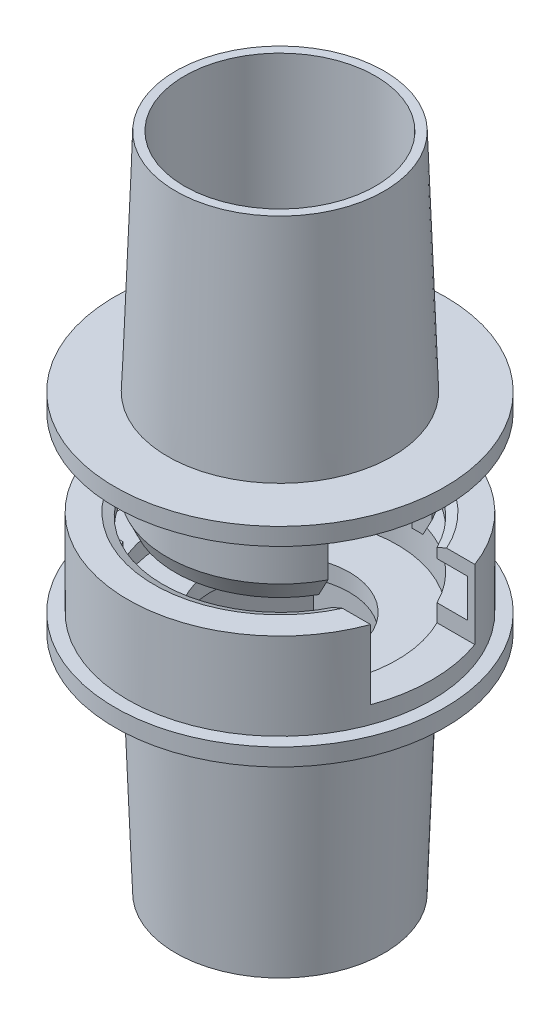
ISO-10303-21;
HEADER;
FILE_DESCRIPTION(('STEP AP214'),'2;1');
FILE_NAME('part.step','',(''),(''),'','','');
FILE_SCHEMA(('AUTOMOTIVE_DESIGN { 1 0 10303 214 1 1 1 1 }'));
ENDSEC;
DATA;
#1=APPLICATION_CONTEXT('core data for automotive mechanical design processes');
#2=APPLICATION_PROTOCOL_DEFINITION('international standard','automotive_design',2000,#1);
#3=PRODUCT_CONTEXT('',#1,'mechanical');
#4=PRODUCT('Part','Part','',(#3));
#5=PRODUCT_RELATED_PRODUCT_CATEGORY('part','',(#4));
#6=PRODUCT_DEFINITION_FORMATION('','',#4);
#7=PRODUCT_DEFINITION_CONTEXT('part definition',#1,'design');
#8=PRODUCT_DEFINITION('design','',#6,#7);
#9=PRODUCT_DEFINITION_SHAPE('','',#8);
#10=(LENGTH_UNIT() NAMED_UNIT(*) SI_UNIT(.MILLI.,.METRE.));
#11=(NAMED_UNIT(*) PLANE_ANGLE_UNIT() SI_UNIT($,.RADIAN.));
#12=(NAMED_UNIT(*) SI_UNIT($,.STERADIAN.) SOLID_ANGLE_UNIT());
#13=UNCERTAINTY_MEASURE_WITH_UNIT(LENGTH_MEASURE(1.E-05),#10,'distance_accuracy_value','');
#14=(GEOMETRIC_REPRESENTATION_CONTEXT(3) GLOBAL_UNCERTAINTY_ASSIGNED_CONTEXT((#13)) GLOBAL_UNIT_ASSIGNED_CONTEXT((#10,
#11,#12)) REPRESENTATION_CONTEXT('',''));
#15=CARTESIAN_POINT('',(0.,0.,0.));
#16=DIRECTION('',(0.,0.,1.));
#17=DIRECTION('',(1.,0.,0.));
#18=AXIS2_PLACEMENT_3D('',#15,#16,#17);
#19=CARTESIAN_POINT('',(0.,-5.,0.));
#20=DIRECTION('',(0.,1.,0.));
#21=DIRECTION('',(0.,0.,1.));
#22=AXIS2_PLACEMENT_3D('',#19,#20,#21);
#23=PLANE('',#22);
#24=DIRECTION('',(-1.,0.,0.));
#25=VECTOR('',#24,1.);
#26=CARTESIAN_POINT('',(0.,-5.,-3.));
#27=LINE('',#26,#25);
#28=CARTESIAN_POINT('',(-6.60018939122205,-5.,-3.));
#29=VERTEX_POINT('',#28);
#30=CARTESIAN_POINT('',(-8.2196411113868,-5.,-3.));
#31=VERTEX_POINT('',#30);
#32=EDGE_CURVE('E338',#29,#31,#27,.T.);
#33=ORIENTED_EDGE('',*,*,#32,.F.);
#34=CARTESIAN_POINT('',(0.,-5.,0.));
#35=DIRECTION('',(0.,1.,0.));
#36=DIRECTION('',(0.,0.,1.));
#37=AXIS2_PLACEMENT_3D('',#34,#35,#36);
#38=CIRCLE('',#37,7.25);
#39=CARTESIAN_POINT('',(6.60018939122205,-5.,-3.));
#40=VERTEX_POINT('',#39);
#41=EDGE_CURVE('E449',#29,#40,#38,.F.);
#42=ORIENTED_EDGE('',*,*,#41,.T.);
#43=CARTESIAN_POINT('',(8.2196411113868,-5.,-3.));
#44=VERTEX_POINT('',#43);
#45=EDGE_CURVE('E342',#44,#40,#27,.T.);
#46=ORIENTED_EDGE('',*,*,#45,.F.);
#47=CARTESIAN_POINT('',(0.,-5.,0.));
#48=DIRECTION('',(0.,1.,0.));
#49=DIRECTION('',(0.,0.,1.));
#50=AXIS2_PLACEMENT_3D('',#47,#48,#49);
#51=CIRCLE('',#50,8.75);
#52=EDGE_CURVE('E391',#44,#31,#51,.T.);
#53=ORIENTED_EDGE('',*,*,#52,.T.);
#54=EDGE_LOOP('',(#33,#42,#46,#53));
#55=FACE_BOUND('',#54,.T.);
#56=ADVANCED_FACE('F58',(#55),#23,.T.);
#57=CARTESIAN_POINT('',(0.,-5.,0.));
#58=DIRECTION('',(0.,-1.,0.));
#59=DIRECTION('',(0.,0.,-1.));
#60=AXIS2_PLACEMENT_3D('',#57,#58,#59);
#61=CYLINDRICAL_SURFACE('',#60,6.75);
#62=DIRECTION('',(0.,-1.,0.));
#63=VECTOR('',#62,1.);
#64=CARTESIAN_POINT('',(6.04669331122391,-5.,-3.));
#65=LINE('',#64,#63);
#66=CARTESIAN_POINT('',(6.04669331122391,-5.2331538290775,-3.));
#67=VERTEX_POINT('',#66);
#68=CARTESIAN_POINT('',(6.04669331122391,-5.8,-3.));
#69=VERTEX_POINT('',#68);
#70=EDGE_CURVE('E349',#67,#69,#65,.T.);
#71=ORIENTED_EDGE('',*,*,#70,.F.);
#72=CARTESIAN_POINT('',(0.,-5.2331538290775,0.));
#73=DIRECTION('',(0.,1.,0.));
#74=DIRECTION('',(0.,0.,1.));
#75=AXIS2_PLACEMENT_3D('',#72,#73,#74);
#76=CIRCLE('',#75,6.75);
#77=CARTESIAN_POINT('',(-6.04669331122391,-5.2331538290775,-3.));
#78=VERTEX_POINT('',#77);
#79=EDGE_CURVE('E437',#67,#78,#76,.T.);
#80=ORIENTED_EDGE('',*,*,#79,.T.);
#81=DIRECTION('',(0.,-1.,0.));
#82=VECTOR('',#81,1.);
#83=CARTESIAN_POINT('',(-6.04669331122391,-5.,-3.));
#84=LINE('',#83,#82);
#85=CARTESIAN_POINT('',(-6.04669331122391,-5.8,-3.));
#86=VERTEX_POINT('',#85);
#87=EDGE_CURVE('E333',#86,#78,#84,.F.);
#88=ORIENTED_EDGE('',*,*,#87,.F.);
#89=CARTESIAN_POINT('',(0.,-5.8,0.));
#90=DIRECTION('',(0.,1.,0.));
#91=DIRECTION('',(0.,0.,1.));
#92=AXIS2_PLACEMENT_3D('',#89,#90,#91);
#93=CIRCLE('',#92,6.75);
#94=EDGE_CURVE('E367',#69,#86,#93,.T.);
#95=ORIENTED_EDGE('',*,*,#94,.F.);
#96=EDGE_LOOP('',(#71,#80,#88,#95));
#97=FACE_BOUND('',#96,.T.);
#98=ADVANCED_FACE('F558',(#97),#61,.F.);
#99=CARTESIAN_POINT('',(0.,-5.8,0.));
#100=DIRECTION('',(0.,1.,0.));
#101=DIRECTION('',(0.,0.,1.));
#102=AXIS2_PLACEMENT_3D('',#99,#100,#101);
#103=PLANE('',#102);
#104=CARTESIAN_POINT('',(0.,-5.8,0.));
#105=DIRECTION('',(0.,1.,0.));
#106=DIRECTION('',(0.,0.,1.));
#107=AXIS2_PLACEMENT_3D('',#104,#105,#106);
#108=CIRCLE('',#107,8.35);
#109=CARTESIAN_POINT('',(7.79246430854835,-5.8,-3.));
#110=VERTEX_POINT('',#109);
#111=CARTESIAN_POINT('',(-7.79246430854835,-5.8,-3.));
#112=VERTEX_POINT('',#111);
#113=EDGE_CURVE('E377',#110,#112,#108,.T.);
#114=ORIENTED_EDGE('',*,*,#113,.F.);
#115=DIRECTION('',(-1.,0.,0.));
#116=VECTOR('',#115,1.);
#117=CARTESIAN_POINT('',(0.,-5.8,-3.));
#118=LINE('',#117,#116);
#119=EDGE_CURVE('E334',#110,#69,#118,.T.);
#120=ORIENTED_EDGE('',*,*,#119,.T.);
#121=ORIENTED_EDGE('',*,*,#94,.T.);
#122=EDGE_CURVE('E328',#86,#112,#118,.T.);
#123=ORIENTED_EDGE('',*,*,#122,.T.);
#124=EDGE_LOOP('',(#114,#120,#121,#123));
#125=FACE_BOUND('',#124,.T.);
#126=ADVANCED_FACE('F565',(#125),#103,.F.);
#127=CARTESIAN_POINT('',(0.,-8.,0.));
#128=DIRECTION('',(0.,1.,0.));
#129=DIRECTION('',(0.,0.,1.));
#130=AXIS2_PLACEMENT_3D('',#127,#128,#129);
#131=PLANE('',#130);
#132=DIRECTION('',(-1.,0.,0.));
#133=VECTOR('',#132,1.);
#134=CARTESIAN_POINT('',(0.,-8.,-3.));
#135=LINE('',#134,#133);
#136=CARTESIAN_POINT('',(7.79246430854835,-8.,-3.));
#137=VERTEX_POINT('',#136);
#138=CARTESIAN_POINT('',(6.04669331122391,-8.,-3.));
#139=VERTEX_POINT('',#138);
#140=EDGE_CURVE('E329',#137,#139,#135,.T.);
#141=ORIENTED_EDGE('',*,*,#140,.F.);
#142=CARTESIAN_POINT('',(0.,-8.,0.));
#143=DIRECTION('',(0.,1.,0.));
#144=DIRECTION('',(0.,0.,1.));
#145=AXIS2_PLACEMENT_3D('',#142,#143,#144);
#146=CIRCLE('',#145,8.35);
#147=CARTESIAN_POINT('',(-7.79246430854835,-8.,-3.));
#148=VERTEX_POINT('',#147);
#149=EDGE_CURVE('E378',#137,#148,#146,.T.);
#150=ORIENTED_EDGE('',*,*,#149,.T.);
#151=CARTESIAN_POINT('',(-6.04669331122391,-8.,-3.));
#152=VERTEX_POINT('',#151);
#153=EDGE_CURVE('E325',#152,#148,#135,.T.);
#154=ORIENTED_EDGE('',*,*,#153,.F.);
#155=CARTESIAN_POINT('',(0.,-8.,0.));
#156=DIRECTION('',(0.,1.,0.));
#157=DIRECTION('',(0.,0.,1.));
#158=AXIS2_PLACEMENT_3D('',#155,#156,#157);
#159=CIRCLE('',#158,6.75);
#160=EDGE_CURVE('E368',#139,#152,#159,.T.);
#161=ORIENTED_EDGE('',*,*,#160,.F.);
#162=EDGE_LOOP('',(#141,#150,#154,#161));
#163=FACE_BOUND('',#162,.T.);
#164=ADVANCED_FACE('F636',(#163),#131,.T.);
#165=CARTESIAN_POINT('',(0.,-5.8,0.));
#166=DIRECTION('',(0.,-1.,0.));
#167=DIRECTION('',(0.,0.,-1.));
#168=AXIS2_PLACEMENT_3D('',#165,#166,#167);
#169=CYLINDRICAL_SURFACE('',#168,8.35);
#170=DIRECTION('',(0.,-1.,0.));
#171=VECTOR('',#170,1.);
#172=CARTESIAN_POINT('',(7.79246430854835,-5.8,-3.));
#173=LINE('',#172,#171);
#174=EDGE_CURVE('E429',#110,#137,#173,.T.);
#175=ORIENTED_EDGE('',*,*,#174,.F.);
#176=ORIENTED_EDGE('',*,*,#113,.T.);
#177=DIRECTION('',(0.,-1.,0.));
#178=VECTOR('',#177,1.);
#179=CARTESIAN_POINT('',(-7.79246430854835,-5.8,-3.));
#180=LINE('',#179,#178);
#181=EDGE_CURVE('E426',#148,#112,#180,.F.);
#182=ORIENTED_EDGE('',*,*,#181,.F.);
#183=ORIENTED_EDGE('',*,*,#149,.F.);
#184=EDGE_LOOP('',(#175,#176,#182,#183));
#185=FACE_BOUND('',#184,.T.);
#186=ADVANCED_FACE('F631',(#185),#169,.F.);
#187=DIRECTION('',(0.,-1.,0.));
#188=VECTOR('',#187,1.);
#189=CARTESIAN_POINT('',(6.04669331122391,-5.,-3.));
#190=LINE('',#189,#188);
#191=CARTESIAN_POINT('',(6.04669331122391,-9.,-3.));
#192=VERTEX_POINT('',#191);
#193=EDGE_CURVE('E352',#139,#192,#190,.T.);
#194=ORIENTED_EDGE('',*,*,#193,.F.);
#195=ORIENTED_EDGE('',*,*,#160,.T.);
#196=DIRECTION('',(0.,-1.,0.));
#197=VECTOR('',#196,1.);
#198=CARTESIAN_POINT('',(-6.04669331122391,-5.,-3.));
#199=LINE('',#198,#197);
#200=CARTESIAN_POINT('',(-6.04669331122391,-9.,-3.));
#201=VERTEX_POINT('',#200);
#202=EDGE_CURVE('E341',#201,#152,#199,.F.);
#203=ORIENTED_EDGE('',*,*,#202,.F.);
#204=CARTESIAN_POINT('',(0.,-9.,0.));
#205=DIRECTION('',(0.,-1.,0.));
#206=DIRECTION('',(0.,0.,-1.));
#207=AXIS2_PLACEMENT_3D('',#204,#205,#206);
#208=CIRCLE('',#207,6.75);
#209=CARTESIAN_POINT('',(-6.04669331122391,-9.,3.));
#210=VERTEX_POINT('',#209);
#211=EDGE_CURVE('E359',#210,#201,#208,.T.);
#212=ORIENTED_EDGE('',*,*,#211,.F.);
#213=DIRECTION('',(0.,-1.,0.));
#214=VECTOR('',#213,1.);
#215=CARTESIAN_POINT('',(-6.04669331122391,-5.,3.));
#216=LINE('',#215,#214);
#217=CARTESIAN_POINT('',(-6.04669331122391,-8.,3.));
#218=VERTEX_POINT('',#217);
#219=EDGE_CURVE('E318',#218,#210,#216,.T.);
#220=ORIENTED_EDGE('',*,*,#219,.F.);
#221=CARTESIAN_POINT('',(6.04669331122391,-8.,3.));
#222=VERTEX_POINT('',#221);
#223=EDGE_CURVE('E369',#218,#222,#159,.T.);
#224=ORIENTED_EDGE('',*,*,#223,.T.);
#225=DIRECTION('',(0.,-1.,0.));
#226=VECTOR('',#225,1.);
#227=CARTESIAN_POINT('',(6.04669331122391,-5.,3.));
#228=LINE('',#227,#226);
#229=CARTESIAN_POINT('',(6.04669331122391,-9.,3.));
#230=VERTEX_POINT('',#229);
#231=EDGE_CURVE('E307',#230,#222,#228,.F.);
#232=ORIENTED_EDGE('',*,*,#231,.F.);
#233=EDGE_CURVE('E362',#192,#230,#208,.T.);
#234=ORIENTED_EDGE('',*,*,#233,.F.);
#235=EDGE_LOOP('',(#194,#195,#203,#212,#220,#224,#232,#234));
#236=FACE_BOUND('',#235,.T.);
#237=CARTESIAN_POINT('',(0.,-10.,0.));
#238=DIRECTION('',(0.,1.,0.));
#239=DIRECTION('',(0.,0.,1.));
#240=AXIS2_PLACEMENT_3D('',#237,#238,#239);
#241=CIRCLE('',#240,6.75);
#242=CARTESIAN_POINT('',(0.,-10.,6.75));
#243=VERTEX_POINT('',#242);
#244=EDGE_CURVE('E383',#243,#243,#241,.T.);
#245=ORIENTED_EDGE('',*,*,#244,.F.);
#246=EDGE_LOOP('',(#245));
#247=FACE_BOUND('',#246,.T.);
#248=ADVANCED_FACE('F568',(#236,#247),#61,.F.);
#249=CARTESIAN_POINT('',(-4.,-10.,0.));
#250=DIRECTION('',(0.,-1.,0.));
#251=DIRECTION('',(0.,0.,1.));
#252=AXIS2_PLACEMENT_3D('',#249,#250,#251);
#253=PLANE('',#252);
#254=CARTESIAN_POINT('',(0.,-10.,0.));
#255=DIRECTION('',(0.,-1.,0.));
#256=DIRECTION('',(0.,0.,-1.));
#257=AXIS2_PLACEMENT_3D('',#254,#255,#256);
#258=CIRCLE('',#257,4.);
#259=CARTESIAN_POINT('',(0.,-10.,-4.));
#260=VERTEX_POINT('',#259);
#261=EDGE_CURVE('E406',#260,#260,#258,.T.);
#262=ORIENTED_EDGE('',*,*,#261,.T.);
#263=EDGE_LOOP('',(#262));
#264=FACE_BOUND('',#263,.T.);
#265=ORIENTED_EDGE('',*,*,#244,.T.);
#266=EDGE_LOOP('',(#265));
#267=FACE_BOUND('',#266,.T.);
#268=ADVANCED_FACE('F798',(#264,#267),#253,.F.);
#269=CARTESIAN_POINT('',(0.,-24.,0.));
#270=DIRECTION('',(0.,1.,0.));
#271=DIRECTION('',(0.,0.,-1.));
#272=AXIS2_PLACEMENT_3D('',#269,#270,#271);
#273=CONICAL_SURFACE('',#272,6.,0.0356991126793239);
#274=CARTESIAN_POINT('',(0.,-11.,0.));
#275=DIRECTION('',(0.,-1.,0.));
#276=DIRECTION('',(0.,0.,-1.));
#277=AXIS2_PLACEMENT_3D('',#274,#275,#276);
#278=CIRCLE('',#277,6.46428571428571);
#279=CARTESIAN_POINT('',(0.,-11.,-6.46428571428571));
#280=VERTEX_POINT('',#279);
#281=EDGE_CURVE('E397',#280,#280,#278,.T.);
#282=ORIENTED_EDGE('',*,*,#281,.T.);
#283=EDGE_LOOP('',(#282));
#284=FACE_BOUND('',#283,.T.);
#285=CARTESIAN_POINT('',(0.,-24.,0.));
#286=DIRECTION('',(0.,-1.,0.));
#287=DIRECTION('',(0.,0.,-1.));
#288=AXIS2_PLACEMENT_3D('',#285,#286,#287);
#289=CIRCLE('',#288,6.);
#290=CARTESIAN_POINT('',(0.,-24.,-6.));
#291=VERTEX_POINT('',#290);
#292=EDGE_CURVE('E398',#291,#291,#289,.T.);
#293=ORIENTED_EDGE('',*,*,#292,.F.);
#294=EDGE_LOOP('',(#293));
#295=FACE_BOUND('',#294,.T.);
#296=ADVANCED_FACE('F818',(#284,#295),#273,.T.);
#297=CARTESIAN_POINT('',(-9.5,-11.,0.));
#298=DIRECTION('',(0.,1.,0.));
#299=DIRECTION('',(0.,0.,-1.));
#300=AXIS2_PLACEMENT_3D('',#297,#298,#299);
#301=PLANE('',#300);
#302=CARTESIAN_POINT('',(0.,-11.,0.));
#303=DIRECTION('',(0.,-1.,0.));
#304=DIRECTION('',(0.,0.,-1.));
#305=AXIS2_PLACEMENT_3D('',#302,#303,#304);
#306=CIRCLE('',#305,9.5);
#307=CARTESIAN_POINT('',(0.,-11.,-9.5));
#308=VERTEX_POINT('',#307);
#309=EDGE_CURVE('E414',#308,#308,#306,.T.);
#310=ORIENTED_EDGE('',*,*,#309,.T.);
#311=EDGE_LOOP('',(#310));
#312=FACE_BOUND('',#311,.T.);
#313=ORIENTED_EDGE('',*,*,#281,.F.);
#314=EDGE_LOOP('',(#313));
#315=FACE_BOUND('',#314,.T.);
#316=ADVANCED_FACE('F866',(#312,#315),#301,.F.);
#317=CARTESIAN_POINT('',(0.,-10.,0.));
#318=DIRECTION('',(0.,1.,0.));
#319=DIRECTION('',(0.,0.,-1.));
#320=AXIS2_PLACEMENT_3D('',#317,#318,#319);
#321=CYLINDRICAL_SURFACE('',#320,9.5);
#322=CARTESIAN_POINT('',(0.,-10.,0.));
#323=DIRECTION('',(0.,-1.,0.));
#324=DIRECTION('',(0.,0.,-1.));
#325=AXIS2_PLACEMENT_3D('',#322,#323,#324);
#326=CIRCLE('',#325,9.5);
#327=CARTESIAN_POINT('',(0.,-10.,-9.5));
#328=VERTEX_POINT('',#327);
#329=EDGE_CURVE('E410',#328,#328,#326,.T.);
#330=ORIENTED_EDGE('',*,*,#329,.T.);
#331=EDGE_LOOP('',(#330));
#332=FACE_BOUND('',#331,.T.);
#333=ORIENTED_EDGE('',*,*,#309,.F.);
#334=EDGE_LOOP('',(#333));
#335=FACE_BOUND('',#334,.T.);
#336=ADVANCED_FACE('F837',(#332,#335),#321,.T.);
#337=CARTESIAN_POINT('',(0.,-10.,0.));
#338=DIRECTION('',(0.,1.,0.));
#339=DIRECTION('',(0.,0.,1.));
#340=AXIS2_PLACEMENT_3D('',#337,#338,#339);
#341=CIRCLE('',#340,8.75);
#342=CARTESIAN_POINT('',(0.,-10.,8.75));
#343=VERTEX_POINT('',#342);
#344=EDGE_CURVE('E392',#343,#343,#341,.T.);
#345=ORIENTED_EDGE('',*,*,#344,.F.);
#346=EDGE_LOOP('',(#345));
#347=FACE_BOUND('',#346,.T.);
#348=ORIENTED_EDGE('',*,*,#329,.F.);
#349=EDGE_LOOP('',(#348));
#350=FACE_BOUND('',#349,.T.);
#351=ADVANCED_FACE('F821',(#347,#350),#253,.F.);
#352=CARTESIAN_POINT('',(0.,-10.,0.));
#353=DIRECTION('',(0.,1.,0.));
#354=DIRECTION('',(0.,0.,-1.));
#355=AXIS2_PLACEMENT_3D('',#352,#353,#354);
#356=CYLINDRICAL_SURFACE('',#355,4.);
#357=CARTESIAN_POINT('',(0.,-11.,0.));
#358=DIRECTION('',(0.,-1.,0.));
#359=DIRECTION('',(0.,0.,-1.));
#360=AXIS2_PLACEMENT_3D('',#357,#358,#359);
#361=CIRCLE('',#360,4.);
#362=CARTESIAN_POINT('',(0.,-11.,-4.));
#363=VERTEX_POINT('',#362);
#364=EDGE_CURVE('E402',#363,#363,#361,.T.);
#365=ORIENTED_EDGE('',*,*,#364,.T.);
#366=EDGE_LOOP('',(#365));
#367=FACE_BOUND('',#366,.T.);
#368=ORIENTED_EDGE('',*,*,#261,.F.);
#369=EDGE_LOOP('',(#368));
#370=FACE_BOUND('',#369,.T.);
#371=ADVANCED_FACE('F829',(#367,#370),#356,.F.);
#372=CARTESIAN_POINT('',(-4.,-11.,0.));
#373=DIRECTION('',(0.,1.,0.));
#374=DIRECTION('',(0.,0.,-1.));
#375=AXIS2_PLACEMENT_3D('',#372,#373,#374);
#376=PLANE('',#375);
#377=DIRECTION('',(-1.,0.,0.));
#378=VECTOR('',#377,1.);
#379=CARTESIAN_POINT('',(2.625,-11.,4.5466333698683));
#380=LINE('',#379,#378);
#381=CARTESIAN_POINT('',(2.625,-11.,4.5466333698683));
#382=VERTEX_POINT('',#381);
#383=CARTESIAN_POINT('',(-2.625,-11.,4.5466333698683));
#384=VERTEX_POINT('',#383);
#385=EDGE_CURVE('E252',#382,#384,#380,.T.);
#386=ORIENTED_EDGE('',*,*,#385,.T.);
#387=DIRECTION('',(-0.5,0.,-0.866025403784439));
#388=VECTOR('',#387,1.);
#389=CARTESIAN_POINT('',(-2.625,-11.,4.5466333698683));
#390=LINE('',#389,#388);
#391=CARTESIAN_POINT('',(-5.25,-11.,0.));
#392=VERTEX_POINT('',#391);
#393=EDGE_CURVE('E81',#384,#392,#390,.T.);
#394=ORIENTED_EDGE('',*,*,#393,.T.);
#395=DIRECTION('',(0.5,0.,-0.866025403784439));
#396=VECTOR('',#395,1.);
#397=CARTESIAN_POINT('',(-5.25,-11.,0.));
#398=LINE('',#397,#396);
#399=CARTESIAN_POINT('',(-2.625,-11.,-4.5466333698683));
#400=VERTEX_POINT('',#399);
#401=EDGE_CURVE('E249',#392,#400,#398,.T.);
#402=ORIENTED_EDGE('',*,*,#401,.T.);
#403=DIRECTION('',(1.,0.,0.));
#404=VECTOR('',#403,1.);
#405=CARTESIAN_POINT('',(-2.625,-11.,-4.5466333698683));
#406=LINE('',#405,#404);
#407=CARTESIAN_POINT('',(2.625,-11.,-4.5466333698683));
#408=VERTEX_POINT('',#407);
#409=EDGE_CURVE('E536',#400,#408,#406,.T.);
#410=ORIENTED_EDGE('',*,*,#409,.T.);
#411=DIRECTION('',(0.5,0.,0.866025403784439));
#412=VECTOR('',#411,1.);
#413=CARTESIAN_POINT('',(2.625,-11.,-4.5466333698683));
#414=LINE('',#413,#412);
#415=CARTESIAN_POINT('',(5.25,-11.,0.));
#416=VERTEX_POINT('',#415);
#417=EDGE_CURVE('E532',#408,#416,#414,.T.);
#418=ORIENTED_EDGE('',*,*,#417,.T.);
#419=DIRECTION('',(-0.5,0.,0.866025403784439));
#420=VECTOR('',#419,1.);
#421=CARTESIAN_POINT('',(5.25,-11.,0.));
#422=LINE('',#421,#420);
#423=EDGE_CURVE('E259',#416,#382,#422,.T.);
#424=ORIENTED_EDGE('',*,*,#423,.T.);
#425=EDGE_LOOP('',(#386,#394,#402,#410,#418,#424));
#426=FACE_BOUND('',#425,.T.);
#427=ORIENTED_EDGE('',*,*,#364,.F.);
#428=EDGE_LOOP('',(#427));
#429=FACE_BOUND('',#428,.T.);
#430=ADVANCED_FACE('F528',(#426,#429),#376,.F.);
#431=CARTESIAN_POINT('',(-5.5,-24.,0.));
#432=DIRECTION('',(0.,1.,0.));
#433=DIRECTION('',(0.,0.,-1.));
#434=AXIS2_PLACEMENT_3D('',#431,#432,#433);
#435=PLANE('',#434);
#436=ORIENTED_EDGE('',*,*,#292,.T.);
#437=EDGE_LOOP('',(#436));
#438=FACE_BOUND('',#437,.T.);
#439=DIRECTION('',(0.5,0.,0.866025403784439));
#440=VECTOR('',#439,1.);
#441=CARTESIAN_POINT('',(-2.625,-24.,4.5466333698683));
#442=LINE('',#441,#440);
#443=CARTESIAN_POINT('',(-5.25,-24.,0.));
#444=VERTEX_POINT('',#443);
#445=CARTESIAN_POINT('',(-2.625,-24.,4.5466333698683));
#446=VERTEX_POINT('',#445);
#447=EDGE_CURVE('E230',#444,#446,#442,.T.);
#448=ORIENTED_EDGE('',*,*,#447,.T.);
#449=DIRECTION('',(1.,0.,0.));
#450=VECTOR('',#449,1.);
#451=CARTESIAN_POINT('',(2.625,-24.,4.5466333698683));
#452=LINE('',#451,#450);
#453=CARTESIAN_POINT('',(2.625,-24.,4.5466333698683));
#454=VERTEX_POINT('',#453);
#455=EDGE_CURVE('E245',#446,#454,#452,.T.);
#456=ORIENTED_EDGE('',*,*,#455,.T.);
#457=DIRECTION('',(0.5,0.,-0.866025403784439));
#458=VECTOR('',#457,1.);
#459=CARTESIAN_POINT('',(5.25,-24.,0.));
#460=LINE('',#459,#458);
#461=CARTESIAN_POINT('',(5.25,-24.,0.));
#462=VERTEX_POINT('',#461);
#463=EDGE_CURVE('E279',#454,#462,#460,.T.);
#464=ORIENTED_EDGE('',*,*,#463,.T.);
#465=DIRECTION('',(-0.5,0.,-0.866025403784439));
#466=VECTOR('',#465,1.);
#467=CARTESIAN_POINT('',(2.625,-24.,-4.5466333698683));
#468=LINE('',#467,#466);
#469=CARTESIAN_POINT('',(2.625,-24.,-4.5466333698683));
#470=VERTEX_POINT('',#469);
#471=EDGE_CURVE('E276',#462,#470,#468,.T.);
#472=ORIENTED_EDGE('',*,*,#471,.T.);
#473=DIRECTION('',(-1.,0.,0.));
#474=VECTOR('',#473,1.);
#475=CARTESIAN_POINT('',(-2.625,-24.,-4.5466333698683));
#476=LINE('',#475,#474);
#477=CARTESIAN_POINT('',(-2.625,-24.,-4.5466333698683));
#478=VERTEX_POINT('',#477);
#479=EDGE_CURVE('E232',#470,#478,#476,.T.);
#480=ORIENTED_EDGE('',*,*,#479,.T.);
#481=DIRECTION('',(-0.5,0.,0.866025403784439));
#482=VECTOR('',#481,1.);
#483=CARTESIAN_POINT('',(-5.25,-24.,0.));
#484=LINE('',#483,#482);
#485=EDGE_CURVE('E227',#478,#444,#484,.T.);
#486=ORIENTED_EDGE('',*,*,#485,.T.);
#487=EDGE_LOOP('',(#448,#456,#464,#472,#480,#486));
#488=FACE_BOUND('',#487,.T.);
#489=ADVANCED_FACE('F229',(#438,#488),#435,.F.);
#490=DIRECTION('',(1.,0.,0.));
#491=VECTOR('',#490,1.);
#492=CARTESIAN_POINT('',(0.,-5.,3.));
#493=LINE('',#492,#491);
#494=CARTESIAN_POINT('',(6.60018939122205,-5.,3.));
#495=VERTEX_POINT('',#494);
#496=CARTESIAN_POINT('',(8.2196411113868,-5.,3.));
#497=VERTEX_POINT('',#496);
#498=EDGE_CURVE('E304',#495,#497,#493,.T.);
#499=ORIENTED_EDGE('',*,*,#498,.F.);
#500=CARTESIAN_POINT('',(0.,-5.,0.));
#501=DIRECTION('',(0.,1.,0.));
#502=DIRECTION('',(0.,0.,1.));
#503=AXIS2_PLACEMENT_3D('',#500,#501,#502);
#504=CIRCLE('',#503,7.25);
#505=CARTESIAN_POINT('',(-6.60018939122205,-5.,3.));
#506=VERTEX_POINT('',#505);
#507=EDGE_CURVE('E74',#495,#506,#504,.F.);
#508=ORIENTED_EDGE('',*,*,#507,.T.);
#509=CARTESIAN_POINT('',(-8.2196411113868,-5.,3.));
#510=VERTEX_POINT('',#509);
#511=EDGE_CURVE('E308',#510,#506,#493,.T.);
#512=ORIENTED_EDGE('',*,*,#511,.F.);
#513=EDGE_CURVE('E387',#510,#497,#51,.T.);
#514=ORIENTED_EDGE('',*,*,#513,.T.);
#515=EDGE_LOOP('',(#499,#508,#512,#514));
#516=FACE_BOUND('',#515,.T.);
#517=ADVANCED_FACE('F561',(#516),#23,.T.);
#518=CARTESIAN_POINT('',(0.,-5.,0.));
#519=DIRECTION('',(0.,-1.,0.));
#520=DIRECTION('',(0.,0.,-1.));
#521=AXIS2_PLACEMENT_3D('',#518,#519,#520);
#522=CYLINDRICAL_SURFACE('',#521,8.75);
#523=ORIENTED_EDGE('',*,*,#52,.F.);
#524=DIRECTION('',(0.,-1.,0.));
#525=VECTOR('',#524,1.);
#526=CARTESIAN_POINT('',(8.2196411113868,-5.,-3.));
#527=LINE('',#526,#525);
#528=CARTESIAN_POINT('',(8.2196411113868,-9.,-3.));
#529=VERTEX_POINT('',#528);
#530=EDGE_CURVE('E355',#44,#529,#527,.T.);
#531=ORIENTED_EDGE('',*,*,#530,.T.);
#532=CARTESIAN_POINT('',(0.,-9.,0.));
#533=DIRECTION('',(0.,-1.,0.));
#534=DIRECTION('',(0.,0.,-1.));
#535=AXIS2_PLACEMENT_3D('',#532,#533,#534);
#536=CIRCLE('',#535,8.75);
#537=CARTESIAN_POINT('',(8.2196411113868,-9.,3.));
#538=VERTEX_POINT('',#537);
#539=EDGE_CURVE('E436',#529,#538,#536,.T.);
#540=ORIENTED_EDGE('',*,*,#539,.T.);
#541=DIRECTION('',(0.,-1.,0.));
#542=VECTOR('',#541,1.);
#543=CARTESIAN_POINT('',(8.2196411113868,-5.,3.));
#544=LINE('',#543,#542);
#545=EDGE_CURVE('E311',#538,#497,#544,.F.);
#546=ORIENTED_EDGE('',*,*,#545,.T.);
#547=ORIENTED_EDGE('',*,*,#513,.F.);
#548=DIRECTION('',(0.,-1.,0.));
#549=VECTOR('',#548,1.);
#550=CARTESIAN_POINT('',(-8.2196411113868,-5.,3.));
#551=LINE('',#550,#549);
#552=CARTESIAN_POINT('',(-8.2196411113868,-9.,3.));
#553=VERTEX_POINT('',#552);
#554=EDGE_CURVE('E321',#510,#553,#551,.T.);
#555=ORIENTED_EDGE('',*,*,#554,.T.);
#556=CARTESIAN_POINT('',(-8.2196411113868,-9.,-3.));
#557=VERTEX_POINT('',#556);
#558=EDGE_CURVE('E432',#553,#557,#536,.T.);
#559=ORIENTED_EDGE('',*,*,#558,.T.);
#560=DIRECTION('',(0.,-1.,0.));
#561=VECTOR('',#560,1.);
#562=CARTESIAN_POINT('',(-8.2196411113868,-5.,-3.));
#563=LINE('',#562,#561);
#564=EDGE_CURVE('E345',#557,#31,#563,.F.);
#565=ORIENTED_EDGE('',*,*,#564,.T.);
#566=EDGE_LOOP('',(#523,#531,#540,#546,#547,#555,#559,#565));
#567=FACE_BOUND('',#566,.T.);
#568=ORIENTED_EDGE('',*,*,#344,.T.);
#569=EDGE_LOOP('',(#568));
#570=FACE_BOUND('',#569,.T.);
#571=ADVANCED_FACE('F573',(#567,#570),#522,.T.);
#572=DIRECTION('',(0.,-1.,0.));
#573=VECTOR('',#572,1.);
#574=CARTESIAN_POINT('',(-6.04669331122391,-5.,3.));
#575=LINE('',#574,#573);
#576=CARTESIAN_POINT('',(-6.04669331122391,-5.2331538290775,3.));
#577=VERTEX_POINT('',#576);
#578=CARTESIAN_POINT('',(-6.04669331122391,-5.8,3.));
#579=VERTEX_POINT('',#578);
#580=EDGE_CURVE('E315',#577,#579,#575,.T.);
#581=ORIENTED_EDGE('',*,*,#580,.F.);
#582=CARTESIAN_POINT('',(0.,-5.2331538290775,0.));
#583=DIRECTION('',(0.,1.,0.));
#584=DIRECTION('',(0.,0.,1.));
#585=AXIS2_PLACEMENT_3D('',#582,#583,#584);
#586=CIRCLE('',#585,6.75);
#587=CARTESIAN_POINT('',(6.04669331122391,-5.2331538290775,3.));
#588=VERTEX_POINT('',#587);
#589=EDGE_CURVE('E476',#577,#588,#586,.T.);
#590=ORIENTED_EDGE('',*,*,#589,.T.);
#591=DIRECTION('',(0.,-1.,0.));
#592=VECTOR('',#591,1.);
#593=CARTESIAN_POINT('',(6.04669331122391,-5.,3.));
#594=LINE('',#593,#592);
#595=CARTESIAN_POINT('',(6.04669331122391,-5.8,3.));
#596=VERTEX_POINT('',#595);
#597=EDGE_CURVE('E299',#596,#588,#594,.F.);
#598=ORIENTED_EDGE('',*,*,#597,.F.);
#599=EDGE_CURVE('E363',#579,#596,#93,.T.);
#600=ORIENTED_EDGE('',*,*,#599,.F.);
#601=EDGE_LOOP('',(#581,#590,#598,#600));
#602=FACE_BOUND('',#601,.T.);
#603=ADVANCED_FACE('F569',(#602),#61,.F.);
#604=CARTESIAN_POINT('',(-7.79246430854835,-5.8,3.));
#605=VERTEX_POINT('',#604);
#606=CARTESIAN_POINT('',(7.79246430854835,-5.8,3.));
#607=VERTEX_POINT('',#606);
#608=EDGE_CURVE('E373',#605,#607,#108,.T.);
#609=ORIENTED_EDGE('',*,*,#608,.F.);
#610=DIRECTION('',(1.,0.,0.));
#611=VECTOR('',#610,1.);
#612=CARTESIAN_POINT('',(0.,-5.8,3.));
#613=LINE('',#612,#611);
#614=EDGE_CURVE('E300',#605,#579,#613,.T.);
#615=ORIENTED_EDGE('',*,*,#614,.T.);
#616=ORIENTED_EDGE('',*,*,#599,.T.);
#617=EDGE_CURVE('E294',#596,#607,#613,.T.);
#618=ORIENTED_EDGE('',*,*,#617,.T.);
#619=EDGE_LOOP('',(#609,#615,#616,#618));
#620=FACE_BOUND('',#619,.T.);
#621=ADVANCED_FACE('F466',(#620),#103,.F.);
#622=DIRECTION('',(1.,0.,0.));
#623=VECTOR('',#622,1.);
#624=CARTESIAN_POINT('',(0.,-8.,3.));
#625=LINE('',#624,#623);
#626=CARTESIAN_POINT('',(-7.79246430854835,-8.,3.));
#627=VERTEX_POINT('',#626);
#628=EDGE_CURVE('E295',#627,#218,#625,.T.);
#629=ORIENTED_EDGE('',*,*,#628,.F.);
#630=CARTESIAN_POINT('',(7.79246430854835,-8.,3.));
#631=VERTEX_POINT('',#630);
#632=EDGE_CURVE('E379',#627,#631,#146,.T.);
#633=ORIENTED_EDGE('',*,*,#632,.T.);
#634=EDGE_CURVE('E291',#222,#631,#625,.T.);
#635=ORIENTED_EDGE('',*,*,#634,.F.);
#636=ORIENTED_EDGE('',*,*,#223,.F.);
#637=EDGE_LOOP('',(#629,#633,#635,#636));
#638=FACE_BOUND('',#637,.T.);
#639=ADVANCED_FACE('F601',(#638),#131,.T.);
#640=DIRECTION('',(0.,-1.,0.));
#641=VECTOR('',#640,1.);
#642=CARTESIAN_POINT('',(-7.79246430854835,-5.8,3.));
#643=LINE('',#642,#641);
#644=EDGE_CURVE('E423',#605,#627,#643,.T.);
#645=ORIENTED_EDGE('',*,*,#644,.F.);
#646=ORIENTED_EDGE('',*,*,#608,.T.);
#647=DIRECTION('',(0.,-1.,0.));
#648=VECTOR('',#647,1.);
#649=CARTESIAN_POINT('',(7.79246430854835,-5.8,3.));
#650=LINE('',#649,#648);
#651=EDGE_CURVE('E396',#631,#607,#650,.F.);
#652=ORIENTED_EDGE('',*,*,#651,.F.);
#653=ORIENTED_EDGE('',*,*,#632,.F.);
#654=EDGE_LOOP('',(#645,#646,#652,#653));
#655=FACE_BOUND('',#654,.T.);
#656=ADVANCED_FACE('F597',(#655),#169,.F.);
#657=CARTESIAN_POINT('',(-9.64938070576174,20.3021162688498,3.));
#658=DIRECTION('',(0.,0.,1.));
#659=DIRECTION('',(1.,0.,0.));
#660=AXIS2_PLACEMENT_3D('',#657,#658,#659);
#661=PLANE('',#660);
#662=ORIENTED_EDGE('',*,*,#597,.T.);
#663=CARTESIAN_POINT('',(6.04669331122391,-5.2331538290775,3.));
#664=CARTESIAN_POINT('',(6.13905459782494,-5.19456057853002,3.));
#665=CARTESIAN_POINT('',(6.23135991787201,-5.15583446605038,3.));
#666=CARTESIAN_POINT('',(6.41585861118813,-5.07811652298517,3.));
#667=CARTESIAN_POINT('',(6.50805198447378,-5.03912469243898,3.));
#668=CARTESIAN_POINT('',(6.60018939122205,-5.,3.));
#669=B_SPLINE_CURVE_WITH_KNOTS('',3,(#663,#664,#665,#666,#667,#668),.UNSPECIFIED.,.F.,.F.,(4,2,
4),(0.,0.300299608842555,0.60059917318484),.UNSPECIFIED.);
#670=EDGE_CURVE('E480',#588,#495,#669,.T.);
#671=ORIENTED_EDGE('',*,*,#670,.T.);
#672=ORIENTED_EDGE('',*,*,#498,.T.);
#673=ORIENTED_EDGE('',*,*,#545,.F.);
#674=DIRECTION('',(-1.,0.,0.));
#675=VECTOR('',#674,1.);
#676=CARTESIAN_POINT('',(-9.64938070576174,-9.,3.));
#677=LINE('',#676,#675);
#678=EDGE_CURVE('E287',#538,#230,#677,.T.);
#679=ORIENTED_EDGE('',*,*,#678,.T.);
#680=ORIENTED_EDGE('',*,*,#231,.T.);
#681=ORIENTED_EDGE('',*,*,#634,.T.);
#682=ORIENTED_EDGE('',*,*,#651,.T.);
#683=ORIENTED_EDGE('',*,*,#617,.F.);
#684=EDGE_LOOP('',(#662,#671,#672,#673,#679,#680,#681,#682,#683));
#685=FACE_BOUND('',#684,.T.);
#686=ADVANCED_FACE('F460',(#685),#661,.F.);
#687=CARTESIAN_POINT('',(-9.64938070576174,20.3021162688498,-3.));
#688=DIRECTION('',(0.,0.,-1.));
#689=DIRECTION('',(-1.,0.,0.));
#690=AXIS2_PLACEMENT_3D('',#687,#688,#689);
#691=PLANE('',#690);
#692=ORIENTED_EDGE('',*,*,#45,.T.);
#693=CARTESIAN_POINT('',(6.60018939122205,-5.,-3.));
#694=CARTESIAN_POINT('',(6.50805198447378,-5.03912469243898,-3.));
#695=CARTESIAN_POINT('',(6.41585861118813,-5.07811652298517,-3.));
#696=CARTESIAN_POINT('',(6.23135991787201,-5.15583446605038,-3.));
#697=CARTESIAN_POINT('',(6.13905459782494,-5.19456057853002,-3.));
#698=CARTESIAN_POINT('',(6.04669331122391,-5.2331538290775,-3.));
#699=B_SPLINE_CURVE_WITH_KNOTS('',3,(#693,#694,#695,#696,#697,#698),.UNSPECIFIED.,.F.,.F.,(4,2,
4),(0.,0.300299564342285,0.60059917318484),.UNSPECIFIED.);
#700=EDGE_CURVE('E469',#40,#67,#699,.T.);
#701=ORIENTED_EDGE('',*,*,#700,.T.);
#702=ORIENTED_EDGE('',*,*,#70,.T.);
#703=ORIENTED_EDGE('',*,*,#119,.F.);
#704=ORIENTED_EDGE('',*,*,#174,.T.);
#705=ORIENTED_EDGE('',*,*,#140,.T.);
#706=ORIENTED_EDGE('',*,*,#193,.T.);
#707=DIRECTION('',(1.,0.,0.));
#708=VECTOR('',#707,1.);
#709=CARTESIAN_POINT('',(-9.64938070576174,-9.,-3.));
#710=LINE('',#709,#708);
#711=EDGE_CURVE('E282',#192,#529,#710,.T.);
#712=ORIENTED_EDGE('',*,*,#711,.T.);
#713=ORIENTED_EDGE('',*,*,#530,.F.);
#714=EDGE_LOOP('',(#692,#701,#702,#703,#704,#705,#706,#712,#713));
#715=FACE_BOUND('',#714,.T.);
#716=ADVANCED_FACE('F455',(#715),#691,.F.);
#717=CARTESIAN_POINT('',(-4.,-9.,0.));
#718=DIRECTION('',(0.,-1.,0.));
#719=DIRECTION('',(0.,0.,1.));
#720=AXIS2_PLACEMENT_3D('',#717,#718,#719);
#721=PLANE('',#720);
#722=ORIENTED_EDGE('',*,*,#233,.T.);
#723=ORIENTED_EDGE('',*,*,#678,.F.);
#724=ORIENTED_EDGE('',*,*,#539,.F.);
#725=ORIENTED_EDGE('',*,*,#711,.F.);
#726=EDGE_LOOP('',(#722,#723,#724,#725));
#727=FACE_BOUND('',#726,.T.);
#728=ADVANCED_FACE('F459',(#727),#721,.F.);
#729=ORIENTED_EDGE('',*,*,#211,.T.);
#730=EDGE_CURVE('E286',#557,#201,#710,.T.);
#731=ORIENTED_EDGE('',*,*,#730,.F.);
#732=ORIENTED_EDGE('',*,*,#558,.F.);
#733=EDGE_CURVE('E237',#210,#553,#677,.T.);
#734=ORIENTED_EDGE('',*,*,#733,.F.);
#735=EDGE_LOOP('',(#729,#731,#732,#734));
#736=FACE_BOUND('',#735,.T.);
#737=ADVANCED_FACE('F613',(#736),#721,.F.);
#738=ORIENTED_EDGE('',*,*,#87,.T.);
#739=CARTESIAN_POINT('',(-6.04669331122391,-5.2331538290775,-3.));
#740=CARTESIAN_POINT('',(-6.13905459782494,-5.19456057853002,-3.));
#741=CARTESIAN_POINT('',(-6.23135991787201,-5.15583446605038,-3.));
#742=CARTESIAN_POINT('',(-6.41585861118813,-5.07811652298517,-3.));
#743=CARTESIAN_POINT('',(-6.50805198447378,-5.03912469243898,-3.));
#744=CARTESIAN_POINT('',(-6.60018939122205,-5.,-3.));
#745=B_SPLINE_CURVE_WITH_KNOTS('',3,(#739,#740,#741,#742,#743,#744),.UNSPECIFIED.,.F.,.F.,(4,2,
4),(0.,0.300299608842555,0.60059917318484),.UNSPECIFIED.);
#746=EDGE_CURVE('E441',#78,#29,#745,.T.);
#747=ORIENTED_EDGE('',*,*,#746,.T.);
#748=ORIENTED_EDGE('',*,*,#32,.T.);
#749=ORIENTED_EDGE('',*,*,#564,.F.);
#750=ORIENTED_EDGE('',*,*,#730,.T.);
#751=ORIENTED_EDGE('',*,*,#202,.T.);
#752=ORIENTED_EDGE('',*,*,#153,.T.);
#753=ORIENTED_EDGE('',*,*,#181,.T.);
#754=ORIENTED_EDGE('',*,*,#122,.F.);
#755=EDGE_LOOP('',(#738,#747,#748,#749,#750,#751,#752,#753,#754));
#756=FACE_BOUND('',#755,.T.);
#757=ADVANCED_FACE('F462',(#756),#691,.F.);
#758=ORIENTED_EDGE('',*,*,#511,.T.);
#759=CARTESIAN_POINT('',(-6.60018939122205,-5.,3.));
#760=CARTESIAN_POINT('',(-6.50805198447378,-5.03912469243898,3.));
#761=CARTESIAN_POINT('',(-6.41585861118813,-5.07811652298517,3.));
#762=CARTESIAN_POINT('',(-6.23135991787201,-5.15583446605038,3.));
#763=CARTESIAN_POINT('',(-6.13905459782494,-5.19456057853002,3.));
#764=CARTESIAN_POINT('',(-6.04669331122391,-5.2331538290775,3.));
#765=B_SPLINE_CURVE_WITH_KNOTS('',3,(#759,#760,#761,#762,#763,#764),.UNSPECIFIED.,.F.,.F.,(4,2,
4),(0.,0.300299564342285,0.60059917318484),.UNSPECIFIED.);
#766=EDGE_CURVE('E14',#506,#577,#765,.T.);
#767=ORIENTED_EDGE('',*,*,#766,.T.);
#768=ORIENTED_EDGE('',*,*,#580,.T.);
#769=ORIENTED_EDGE('',*,*,#614,.F.);
#770=ORIENTED_EDGE('',*,*,#644,.T.);
#771=ORIENTED_EDGE('',*,*,#628,.T.);
#772=ORIENTED_EDGE('',*,*,#219,.T.);
#773=ORIENTED_EDGE('',*,*,#733,.T.);
#774=ORIENTED_EDGE('',*,*,#554,.F.);
#775=EDGE_LOOP('',(#758,#767,#768,#769,#770,#771,#772,#773,#774));
#776=FACE_BOUND('',#775,.T.);
#777=ADVANCED_FACE('F463',(#776),#661,.F.);
#778=CARTESIAN_POINT('',(0.,-5.2331538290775,0.));
#779=DIRECTION('',(0.,1.,0.));
#780=DIRECTION('',(0.,0.,1.));
#781=AXIS2_PLACEMENT_3D('',#778,#779,#780);
#782=CONICAL_SURFACE('',#781,6.75,1.13446401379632);
#783=ORIENTED_EDGE('',*,*,#700,.F.);
#784=ORIENTED_EDGE('',*,*,#41,.F.);
#785=ORIENTED_EDGE('',*,*,#746,.F.);
#786=ORIENTED_EDGE('',*,*,#79,.F.);
#787=EDGE_LOOP('',(#783,#784,#785,#786));
#788=FACE_BOUND('',#787,.T.);
#789=ADVANCED_FACE('F452',(#788),#782,.F.);
#790=CARTESIAN_POINT('',(0.,-5.2331538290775,0.));
#791=DIRECTION('',(0.,1.,0.));
#792=DIRECTION('',(0.,0.,1.));
#793=AXIS2_PLACEMENT_3D('',#790,#791,#792);
#794=CONICAL_SURFACE('',#793,6.75,1.13446401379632);
#795=ORIENTED_EDGE('',*,*,#766,.F.);
#796=ORIENTED_EDGE('',*,*,#507,.F.);
#797=ORIENTED_EDGE('',*,*,#670,.F.);
#798=ORIENTED_EDGE('',*,*,#589,.F.);
#799=EDGE_LOOP('',(#795,#796,#797,#798));
#800=FACE_BOUND('',#799,.T.);
#801=ADVANCED_FACE('F61',(#800),#794,.F.);
#802=CARTESIAN_POINT('',(-2.625,-39.556349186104,4.5466333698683));
#803=DIRECTION('',(0.866025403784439,0.,-0.5));
#804=DIRECTION('',(-0.5,0.,-0.866025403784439));
#805=AXIS2_PLACEMENT_3D('',#802,#803,#804);
#806=PLANE('',#805);
#807=ORIENTED_EDGE('',*,*,#447,.F.);
#808=DIRECTION('',(0.,1.,0.));
#809=VECTOR('',#808,1.);
#810=CARTESIAN_POINT('',(-5.25,-39.556349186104,0.));
#811=LINE('',#810,#809);
#812=EDGE_CURVE('E240',#444,#392,#811,.T.);
#813=ORIENTED_EDGE('',*,*,#812,.T.);
#814=ORIENTED_EDGE('',*,*,#393,.F.);
#815=DIRECTION('',(0.,1.,0.));
#816=VECTOR('',#815,1.);
#817=CARTESIAN_POINT('',(-2.625,-39.556349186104,4.5466333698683));
#818=LINE('',#817,#816);
#819=EDGE_CURVE('E242',#446,#384,#818,.T.);
#820=ORIENTED_EDGE('',*,*,#819,.F.);
#821=EDGE_LOOP('',(#807,#813,#814,#820));
#822=FACE_BOUND('',#821,.T.);
#823=ADVANCED_FACE('F239',(#822),#806,.T.);
#824=CARTESIAN_POINT('',(-5.25,-39.556349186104,0.));
#825=DIRECTION('',(0.866025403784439,0.,0.5));
#826=DIRECTION('',(0.5,0.,-0.866025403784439));
#827=AXIS2_PLACEMENT_3D('',#824,#825,#826);
#828=PLANE('',#827);
#829=ORIENTED_EDGE('',*,*,#485,.F.);
#830=DIRECTION('',(0.,1.,0.));
#831=VECTOR('',#830,1.);
#832=CARTESIAN_POINT('',(-2.625,-39.556349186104,-4.5466333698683));
#833=LINE('',#832,#831);
#834=EDGE_CURVE('E251',#478,#400,#833,.T.);
#835=ORIENTED_EDGE('',*,*,#834,.T.);
#836=ORIENTED_EDGE('',*,*,#401,.F.);
#837=ORIENTED_EDGE('',*,*,#812,.F.);
#838=EDGE_LOOP('',(#829,#835,#836,#837));
#839=FACE_BOUND('',#838,.T.);
#840=ADVANCED_FACE('F247',(#839),#828,.T.);
#841=CARTESIAN_POINT('',(-2.625,-39.556349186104,-4.5466333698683));
#842=DIRECTION('',(0.,0.,1.));
#843=DIRECTION('',(1.,0.,0.));
#844=AXIS2_PLACEMENT_3D('',#841,#842,#843);
#845=PLANE('',#844);
#846=ORIENTED_EDGE('',*,*,#479,.F.);
#847=DIRECTION('',(0.,1.,0.));
#848=VECTOR('',#847,1.);
#849=CARTESIAN_POINT('',(2.625,-39.556349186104,-4.5466333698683));
#850=LINE('',#849,#848);
#851=EDGE_CURVE('E256',#470,#408,#850,.T.);
#852=ORIENTED_EDGE('',*,*,#851,.T.);
#853=ORIENTED_EDGE('',*,*,#409,.F.);
#854=ORIENTED_EDGE('',*,*,#834,.F.);
#855=EDGE_LOOP('',(#846,#852,#853,#854));
#856=FACE_BOUND('',#855,.T.);
#857=ADVANCED_FACE('F545',(#856),#845,.T.);
#858=CARTESIAN_POINT('',(2.625,-39.556349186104,-4.5466333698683));
#859=DIRECTION('',(-0.866025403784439,0.,0.5));
#860=DIRECTION('',(0.5,0.,0.866025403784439));
#861=AXIS2_PLACEMENT_3D('',#858,#859,#860);
#862=PLANE('',#861);
#863=ORIENTED_EDGE('',*,*,#471,.F.);
#864=DIRECTION('',(0.,1.,0.));
#865=VECTOR('',#864,1.);
#866=CARTESIAN_POINT('',(5.25,-39.556349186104,0.));
#867=LINE('',#866,#865);
#868=EDGE_CURVE('E266',#462,#416,#867,.T.);
#869=ORIENTED_EDGE('',*,*,#868,.T.);
#870=ORIENTED_EDGE('',*,*,#417,.F.);
#871=ORIENTED_EDGE('',*,*,#851,.F.);
#872=EDGE_LOOP('',(#863,#869,#870,#871));
#873=FACE_BOUND('',#872,.T.);
#874=ADVANCED_FACE('F548',(#873),#862,.T.);
#875=CARTESIAN_POINT('',(5.25,-39.556349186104,0.));
#876=DIRECTION('',(-0.866025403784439,0.,-0.5));
#877=DIRECTION('',(-0.5,0.,0.866025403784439));
#878=AXIS2_PLACEMENT_3D('',#875,#876,#877);
#879=PLANE('',#878);
#880=ORIENTED_EDGE('',*,*,#463,.F.);
#881=DIRECTION('',(0.,1.,0.));
#882=VECTOR('',#881,1.);
#883=CARTESIAN_POINT('',(2.625,-39.556349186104,4.5466333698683));
#884=LINE('',#883,#882);
#885=EDGE_CURVE('E269',#454,#382,#884,.T.);
#886=ORIENTED_EDGE('',*,*,#885,.T.);
#887=ORIENTED_EDGE('',*,*,#423,.F.);
#888=ORIENTED_EDGE('',*,*,#868,.F.);
#889=EDGE_LOOP('',(#880,#886,#887,#888));
#890=FACE_BOUND('',#889,.T.);
#891=ADVANCED_FACE('F521',(#890),#879,.T.);
#892=CARTESIAN_POINT('',(2.625,-39.556349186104,4.5466333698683));
#893=DIRECTION('',(0.,0.,-1.));
#894=DIRECTION('',(-1.,0.,0.));
#895=AXIS2_PLACEMENT_3D('',#892,#893,#894);
#896=PLANE('',#895);
#897=ORIENTED_EDGE('',*,*,#455,.F.);
#898=ORIENTED_EDGE('',*,*,#819,.T.);
#899=ORIENTED_EDGE('',*,*,#385,.F.);
#900=ORIENTED_EDGE('',*,*,#885,.F.);
#901=EDGE_LOOP('',(#897,#898,#899,#900));
#902=FACE_BOUND('',#901,.T.);
#903=ADVANCED_FACE('F524',(#902),#896,.T.);
#904=CLOSED_SHELL('',(#56,#98,#126,#164,#186,#248,#268,#296,#316,#336,#351,#371,#430,#489,#517,
#571,#603,#621,#639,#656,#686,#716,#728,#737,#757,#777,#789,#801,#823,#840,#857,#874,#891,#903));
#905=MANIFOLD_SOLID_BREP('B2',#904);
#906=CARTESIAN_POINT('',(-5.5,-5.,0.));
#907=DIRECTION('',(0.,1.,0.));
#908=DIRECTION('',(0.,0.,1.));
#909=AXIS2_PLACEMENT_3D('',#906,#907,#908);
#910=PLANE('',#909);
#911=DIRECTION('',(-1.,0.,0.));
#912=VECTOR('',#911,1.);
#913=CARTESIAN_POINT('',(-5.5,-5.,-3.));
#914=LINE('',#913,#912);
#915=CARTESIAN_POINT('',(-4.60977222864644,-5.,-3.));
#916=VERTEX_POINT('',#915);
#917=CARTESIAN_POINT('',(-5.2350208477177,-5.,-3.));
#918=VERTEX_POINT('',#917);
#919=EDGE_CURVE('E1042',#916,#918,#914,.T.);
#920=ORIENTED_EDGE('',*,*,#919,.T.);
#921=CARTESIAN_POINT('',(0.,-5.,0.));
#922=DIRECTION('',(0.,1.,0.));
#923=DIRECTION('',(0.,0.,1.));
#924=AXIS2_PLACEMENT_3D('',#921,#922,#923);
#925=CIRCLE('',#924,6.03369234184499);
#926=CARTESIAN_POINT('',(5.2350208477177,-5.,-3.));
#927=VERTEX_POINT('',#926);
#928=EDGE_CURVE('E1097',#918,#927,#925,.F.);
#929=ORIENTED_EDGE('',*,*,#928,.T.);
#930=CARTESIAN_POINT('',(4.60977222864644,-5.,-3.));
#931=VERTEX_POINT('',#930);
#932=EDGE_CURVE('E1046',#927,#931,#914,.T.);
#933=ORIENTED_EDGE('',*,*,#932,.T.);
#934=CARTESIAN_POINT('',(0.,-5.,0.));
#935=DIRECTION('',(0.,-1.,0.));
#936=DIRECTION('',(0.,0.,-1.));
#937=AXIS2_PLACEMENT_3D('',#934,#935,#936);
#938=CIRCLE('',#937,5.5);
#939=EDGE_CURVE('E1068',#916,#931,#938,.T.);
#940=ORIENTED_EDGE('',*,*,#939,.F.);
#941=EDGE_LOOP('',(#920,#929,#933,#940));
#942=FACE_BOUND('',#941,.T.);
#943=ADVANCED_FACE('F925',(#942),#910,.F.);
#944=CARTESIAN_POINT('',(0.,14.,0.));
#945=DIRECTION('',(0.,-1.,0.));
#946=DIRECTION('',(0.,0.,-1.));
#947=AXIS2_PLACEMENT_3D('',#944,#945,#946);
#948=CONICAL_SURFACE('',#947,6.,0.0356991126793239);
#949=CARTESIAN_POINT('',(0.,1.,0.));
#950=DIRECTION('',(0.,-1.,0.));
#951=DIRECTION('',(0.,0.,-1.));
#952=AXIS2_PLACEMENT_3D('',#949,#950,#951);
#953=CIRCLE('',#952,6.46428571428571);
#954=CARTESIAN_POINT('',(0.,1.,-6.46428571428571));
#955=VERTEX_POINT('',#954);
#956=EDGE_CURVE('E1081',#955,#955,#953,.T.);
#957=ORIENTED_EDGE('',*,*,#956,.F.);
#958=EDGE_LOOP('',(#957));
#959=FACE_BOUND('',#958,.T.);
#960=CARTESIAN_POINT('',(0.,14.,0.));
#961=DIRECTION('',(0.,-1.,0.));
#962=DIRECTION('',(0.,0.,-1.));
#963=AXIS2_PLACEMENT_3D('',#960,#961,#962);
#964=CIRCLE('',#963,6.);
#965=CARTESIAN_POINT('',(0.,14.,-6.));
#966=VERTEX_POINT('',#965);
#967=EDGE_CURVE('E1027',#966,#966,#964,.T.);
#968=ORIENTED_EDGE('',*,*,#967,.T.);
#969=EDGE_LOOP('',(#968));
#970=FACE_BOUND('',#969,.T.);
#971=ADVANCED_FACE('F1174',(#959,#970),#948,.T.);
#972=CARTESIAN_POINT('',(-9.5,1.,0.));
#973=DIRECTION('',(0.,-1.,0.));
#974=DIRECTION('',(0.,0.,-1.));
#975=AXIS2_PLACEMENT_3D('',#972,#973,#974);
#976=PLANE('',#975);
#977=CARTESIAN_POINT('',(0.,1.,0.));
#978=DIRECTION('',(0.,-1.,0.));
#979=DIRECTION('',(0.,0.,-1.));
#980=AXIS2_PLACEMENT_3D('',#977,#978,#979);
#981=CIRCLE('',#980,9.5);
#982=CARTESIAN_POINT('',(0.,1.,-9.5));
#983=VERTEX_POINT('',#982);
#984=EDGE_CURVE('E1078',#983,#983,#981,.T.);
#985=ORIENTED_EDGE('',*,*,#984,.F.);
#986=EDGE_LOOP('',(#985));
#987=FACE_BOUND('',#986,.T.);
#988=ORIENTED_EDGE('',*,*,#956,.T.);
#989=EDGE_LOOP('',(#988));
#990=FACE_BOUND('',#989,.T.);
#991=ADVANCED_FACE('F1178',(#987,#990),#976,.F.);
#992=CARTESIAN_POINT('',(0.,0.,0.));
#993=DIRECTION('',(0.,-1.,0.));
#994=DIRECTION('',(0.,0.,-1.));
#995=AXIS2_PLACEMENT_3D('',#992,#993,#994);
#996=CYLINDRICAL_SURFACE('',#995,9.5);
#997=CARTESIAN_POINT('',(0.,0.,0.));
#998=DIRECTION('',(0.,-1.,0.));
#999=DIRECTION('',(0.,0.,-1.));
#1000=AXIS2_PLACEMENT_3D('',#997,#998,#999);
#1001=CIRCLE('',#1000,9.5);
#1002=CARTESIAN_POINT('',(0.,0.,-9.5));
#1003=VERTEX_POINT('',#1002);
#1004=EDGE_CURVE('E1075',#1003,#1003,#1001,.T.);
#1005=ORIENTED_EDGE('',*,*,#1004,.F.);
#1006=EDGE_LOOP('',(#1005));
#1007=FACE_BOUND('',#1006,.T.);
#1008=ORIENTED_EDGE('',*,*,#984,.T.);
#1009=EDGE_LOOP('',(#1008));
#1010=FACE_BOUND('',#1009,.T.);
#1011=ADVANCED_FACE('F1183',(#1007,#1010),#996,.T.);
#1012=CARTESIAN_POINT('',(-6.5,0.,0.));
#1013=DIRECTION('',(0.,1.,0.));
#1014=DIRECTION('',(0.,0.,1.));
#1015=AXIS2_PLACEMENT_3D('',#1012,#1013,#1014);
#1016=PLANE('',#1015);
#1017=CARTESIAN_POINT('',(0.,0.,0.));
#1018=DIRECTION('',(0.,-1.,0.));
#1019=DIRECTION('',(0.,0.,-1.));
#1020=AXIS2_PLACEMENT_3D('',#1017,#1018,#1019);
#1021=CIRCLE('',#1020,6.5);
#1022=CARTESIAN_POINT('',(0.,0.,-6.5));
#1023=VERTEX_POINT('',#1022);
#1024=EDGE_CURVE('E1072',#1023,#1023,#1021,.T.);
#1025=ORIENTED_EDGE('',*,*,#1024,.F.);
#1026=EDGE_LOOP('',(#1025));
#1027=FACE_BOUND('',#1026,.T.);
#1028=ORIENTED_EDGE('',*,*,#1004,.T.);
#1029=EDGE_LOOP('',(#1028));
#1030=FACE_BOUND('',#1029,.T.);
#1031=ADVANCED_FACE('F1171',(#1027,#1030),#1016,.F.);
#1032=CARTESIAN_POINT('',(0.,0.,0.));
#1033=DIRECTION('',(0.,-1.,0.));
#1034=DIRECTION('',(0.,0.,-1.));
#1035=AXIS2_PLACEMENT_3D('',#1032,#1033,#1034);
#1036=CYLINDRICAL_SURFACE('',#1035,6.5);
#1037=DIRECTION('',(0.,-1.,0.));
#1038=VECTOR('',#1037,1.);
#1039=CARTESIAN_POINT('',(5.7662812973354,0.,-3.));
#1040=LINE('',#1039,#1038);
#1041=CARTESIAN_POINT('',(5.7662812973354,-1.,-3.));
#1042=VERTEX_POINT('',#1041);
#1043=CARTESIAN_POINT('',(5.7662812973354,-3.99999999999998,-3.));
#1044=VERTEX_POINT('',#1043);
#1045=EDGE_CURVE('E1048',#1042,#1044,#1040,.T.);
#1046=ORIENTED_EDGE('',*,*,#1045,.T.);
#1047=CARTESIAN_POINT('',(0.,-3.99999999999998,0.));
#1048=DIRECTION('',(0.,1.,0.));
#1049=DIRECTION('',(0.,0.,1.));
#1050=AXIS2_PLACEMENT_3D('',#1047,#1048,#1049);
#1051=CIRCLE('',#1050,6.5);
#1052=CARTESIAN_POINT('',(-5.7662812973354,-3.99999999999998,-3.));
#1053=VERTEX_POINT('',#1052);
#1054=EDGE_CURVE('E1131',#1044,#1053,#1051,.T.);
#1055=ORIENTED_EDGE('',*,*,#1054,.T.);
#1056=DIRECTION('',(0.,-1.,0.));
#1057=VECTOR('',#1056,1.);
#1058=CARTESIAN_POINT('',(-5.7662812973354,0.,-3.));
#1059=LINE('',#1058,#1057);
#1060=CARTESIAN_POINT('',(-5.7662812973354,-1.,-3.));
#1061=VERTEX_POINT('',#1060);
#1062=EDGE_CURVE('E1045',#1053,#1061,#1059,.F.);
#1063=ORIENTED_EDGE('',*,*,#1062,.T.);
#1064=CARTESIAN_POINT('',(0.,-1.,0.));
#1065=DIRECTION('',(0.,1.,0.));
#1066=DIRECTION('',(0.,0.,1.));
#1067=AXIS2_PLACEMENT_3D('',#1064,#1065,#1066);
#1068=CIRCLE('',#1067,6.5);
#1069=CARTESIAN_POINT('',(-5.7662812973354,-1.,3.));
#1070=VERTEX_POINT('',#1069);
#1071=EDGE_CURVE('E1028',#1061,#1070,#1068,.T.);
#1072=ORIENTED_EDGE('',*,*,#1071,.T.);
#1073=DIRECTION('',(0.,-1.,0.));
#1074=VECTOR('',#1073,1.);
#1075=CARTESIAN_POINT('',(-5.7662812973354,0.,3.));
#1076=LINE('',#1075,#1074);
#1077=CARTESIAN_POINT('',(-5.7662812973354,-3.99999999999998,3.));
#1078=VERTEX_POINT('',#1077);
#1079=EDGE_CURVE('E1040',#1070,#1078,#1076,.T.);
#1080=ORIENTED_EDGE('',*,*,#1079,.T.);
#1081=CARTESIAN_POINT('',(0.,-3.99999999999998,0.));
#1082=DIRECTION('',(0.,1.,0.));
#1083=DIRECTION('',(0.,0.,1.));
#1084=AXIS2_PLACEMENT_3D('',#1081,#1082,#1083);
#1085=CIRCLE('',#1084,6.5);
#1086=CARTESIAN_POINT('',(5.7662812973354,-3.99999999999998,3.));
#1087=VERTEX_POINT('',#1086);
#1088=EDGE_CURVE('E1014',#1078,#1087,#1085,.T.);
#1089=ORIENTED_EDGE('',*,*,#1088,.T.);
#1090=DIRECTION('',(0.,-1.,0.));
#1091=VECTOR('',#1090,1.);
#1092=CARTESIAN_POINT('',(5.7662812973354,0.,3.));
#1093=LINE('',#1092,#1091);
#1094=CARTESIAN_POINT('',(5.7662812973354,-1.,3.));
#1095=VERTEX_POINT('',#1094);
#1096=EDGE_CURVE('E1007',#1087,#1095,#1093,.F.);
#1097=ORIENTED_EDGE('',*,*,#1096,.T.);
#1098=EDGE_CURVE('E1012',#1095,#1042,#1068,.T.);
#1099=ORIENTED_EDGE('',*,*,#1098,.T.);
#1100=EDGE_LOOP('',(#1046,#1055,#1063,#1072,#1080,#1089,#1097,#1099));
#1101=FACE_BOUND('',#1100,.T.);
#1102=ORIENTED_EDGE('',*,*,#1024,.T.);
#1103=EDGE_LOOP('',(#1102));
#1104=FACE_BOUND('',#1103,.T.);
#1105=ADVANCED_FACE('F1010',(#1101,#1104),#1036,.T.);
#1106=DIRECTION('',(1.,0.,0.));
#1107=VECTOR('',#1106,1.);
#1108=CARTESIAN_POINT('',(-5.5,-5.,3.));
#1109=LINE('',#1108,#1107);
#1110=CARTESIAN_POINT('',(4.60977222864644,-5.,3.));
#1111=VERTEX_POINT('',#1110);
#1112=CARTESIAN_POINT('',(5.2350208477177,-5.,3.));
#1113=VERTEX_POINT('',#1112);
#1114=EDGE_CURVE('E1017',#1111,#1113,#1109,.T.);
#1115=ORIENTED_EDGE('',*,*,#1114,.T.);
#1116=CARTESIAN_POINT('',(0.,-5.,0.));
#1117=DIRECTION('',(0.,1.,0.));
#1118=DIRECTION('',(0.,0.,1.));
#1119=AXIS2_PLACEMENT_3D('',#1116,#1117,#1118);
#1120=CIRCLE('',#1119,6.03369234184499);
#1121=CARTESIAN_POINT('',(-5.2350208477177,-5.,3.));
#1122=VERTEX_POINT('',#1121);
#1123=EDGE_CURVE('E1130',#1113,#1122,#1120,.F.);
#1124=ORIENTED_EDGE('',*,*,#1123,.T.);
#1125=CARTESIAN_POINT('',(-4.60977222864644,-5.,3.));
#1126=VERTEX_POINT('',#1125);
#1127=EDGE_CURVE('E1016',#1122,#1126,#1109,.T.);
#1128=ORIENTED_EDGE('',*,*,#1127,.T.);
#1129=EDGE_CURVE('E1071',#1111,#1126,#938,.T.);
#1130=ORIENTED_EDGE('',*,*,#1129,.F.);
#1131=EDGE_LOOP('',(#1115,#1124,#1128,#1130));
#1132=FACE_BOUND('',#1131,.T.);
#1133=ADVANCED_FACE('F1161',(#1132),#910,.F.);
#1134=CARTESIAN_POINT('',(0.,0.,0.));
#1135=DIRECTION('',(0.,-1.,0.));
#1136=DIRECTION('',(0.,0.,-1.));
#1137=AXIS2_PLACEMENT_3D('',#1134,#1135,#1136);
#1138=CYLINDRICAL_SURFACE('',#1137,5.5);
#1139=CARTESIAN_POINT('',(0.,0.,0.));
#1140=DIRECTION('',(0.,-1.,0.));
#1141=DIRECTION('',(0.,0.,-1.));
#1142=AXIS2_PLACEMENT_3D('',#1139,#1140,#1141);
#1143=CIRCLE('',#1142,5.5);
#1144=CARTESIAN_POINT('',(0.,0.,-5.5));
#1145=VERTEX_POINT('',#1144);
#1146=EDGE_CURVE('E1065',#1145,#1145,#1143,.T.);
#1147=ORIENTED_EDGE('',*,*,#1146,.F.);
#1148=EDGE_LOOP('',(#1147));
#1149=FACE_BOUND('',#1148,.T.);
#1150=CARTESIAN_POINT('',(0.,-1.,0.));
#1151=DIRECTION('',(0.,1.,0.));
#1152=DIRECTION('',(0.,0.,1.));
#1153=AXIS2_PLACEMENT_3D('',#1150,#1151,#1152);
#1154=CIRCLE('',#1153,5.5);
#1155=CARTESIAN_POINT('',(-4.60977222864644,-1.,3.));
#1156=VERTEX_POINT('',#1155);
#1157=CARTESIAN_POINT('',(-4.60977222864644,-1.,-3.));
#1158=VERTEX_POINT('',#1157);
#1159=EDGE_CURVE('E1088',#1156,#1158,#1154,.F.);
#1160=ORIENTED_EDGE('',*,*,#1159,.T.);
#1161=DIRECTION('',(0.,-1.,0.));
#1162=VECTOR('',#1161,1.);
#1163=CARTESIAN_POINT('',(-4.60977222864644,0.,-3.));
#1164=LINE('',#1163,#1162);
#1165=EDGE_CURVE('E1094',#1158,#916,#1164,.T.);
#1166=ORIENTED_EDGE('',*,*,#1165,.T.);
#1167=ORIENTED_EDGE('',*,*,#939,.T.);
#1168=DIRECTION('',(0.,-1.,0.));
#1169=VECTOR('',#1168,1.);
#1170=CARTESIAN_POINT('',(4.60977222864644,0.,-3.));
#1171=LINE('',#1170,#1169);
#1172=CARTESIAN_POINT('',(4.60977222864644,-1.,-3.));
#1173=VERTEX_POINT('',#1172);
#1174=EDGE_CURVE('E1087',#931,#1173,#1171,.F.);
#1175=ORIENTED_EDGE('',*,*,#1174,.T.);
#1176=CARTESIAN_POINT('',(4.60977222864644,-1.,3.));
#1177=VERTEX_POINT('',#1176);
#1178=EDGE_CURVE('E1085',#1173,#1177,#1154,.F.);
#1179=ORIENTED_EDGE('',*,*,#1178,.T.);
#1180=DIRECTION('',(0.,-1.,0.));
#1181=VECTOR('',#1180,1.);
#1182=CARTESIAN_POINT('',(4.60977222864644,0.,3.));
#1183=LINE('',#1182,#1181);
#1184=EDGE_CURVE('E1032',#1177,#1111,#1183,.T.);
#1185=ORIENTED_EDGE('',*,*,#1184,.T.);
#1186=ORIENTED_EDGE('',*,*,#1129,.T.);
#1187=DIRECTION('',(0.,-1.,0.));
#1188=VECTOR('',#1187,1.);
#1189=CARTESIAN_POINT('',(-4.60977222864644,0.,3.));
#1190=LINE('',#1189,#1188);
#1191=EDGE_CURVE('E1091',#1126,#1156,#1190,.F.);
#1192=ORIENTED_EDGE('',*,*,#1191,.T.);
#1193=EDGE_LOOP('',(#1160,#1166,#1167,#1175,#1179,#1185,#1186,#1192));
#1194=FACE_BOUND('',#1193,.T.);
#1195=ADVANCED_FACE('F1154',(#1149,#1194),#1138,.F.);
#1196=CARTESIAN_POINT('',(-4.,0.,0.));
#1197=DIRECTION('',(0.,1.,0.));
#1198=DIRECTION('',(0.,0.,1.));
#1199=AXIS2_PLACEMENT_3D('',#1196,#1197,#1198);
#1200=PLANE('',#1199);
#1201=CARTESIAN_POINT('',(0.,0.,0.));
#1202=DIRECTION('',(0.,-1.,0.));
#1203=DIRECTION('',(0.,0.,-1.));
#1204=AXIS2_PLACEMENT_3D('',#1201,#1202,#1203);
#1205=CIRCLE('',#1204,4.);
#1206=CARTESIAN_POINT('',(0.,0.,-4.));
#1207=VERTEX_POINT('',#1206);
#1208=EDGE_CURVE('E1062',#1207,#1207,#1205,.T.);
#1209=ORIENTED_EDGE('',*,*,#1208,.F.);
#1210=EDGE_LOOP('',(#1209));
#1211=FACE_BOUND('',#1210,.T.);
#1212=ORIENTED_EDGE('',*,*,#1146,.T.);
#1213=EDGE_LOOP('',(#1212));
#1214=FACE_BOUND('',#1213,.T.);
#1215=ADVANCED_FACE('F1168',(#1211,#1214),#1200,.F.);
#1216=CARTESIAN_POINT('',(0.,0.,0.));
#1217=DIRECTION('',(0.,-1.,0.));
#1218=DIRECTION('',(0.,0.,-1.));
#1219=AXIS2_PLACEMENT_3D('',#1216,#1217,#1218);
#1220=CYLINDRICAL_SURFACE('',#1219,4.);
#1221=CARTESIAN_POINT('',(0.,1.,0.));
#1222=DIRECTION('',(0.,-1.,0.));
#1223=DIRECTION('',(0.,0.,-1.));
#1224=AXIS2_PLACEMENT_3D('',#1221,#1222,#1223);
#1225=CIRCLE('',#1224,4.);
#1226=CARTESIAN_POINT('',(0.,1.,-4.));
#1227=VERTEX_POINT('',#1226);
#1228=EDGE_CURVE('E1059',#1227,#1227,#1225,.T.);
#1229=ORIENTED_EDGE('',*,*,#1228,.F.);
#1230=EDGE_LOOP('',(#1229));
#1231=FACE_BOUND('',#1230,.T.);
#1232=ORIENTED_EDGE('',*,*,#1208,.T.);
#1233=EDGE_LOOP('',(#1232));
#1234=FACE_BOUND('',#1233,.T.);
#1235=ADVANCED_FACE('F1304',(#1231,#1234),#1220,.F.);
#1236=CARTESIAN_POINT('',(-4.,1.,0.));
#1237=DIRECTION('',(0.,-1.,0.));
#1238=DIRECTION('',(0.,0.,-1.));
#1239=AXIS2_PLACEMENT_3D('',#1236,#1237,#1238);
#1240=PLANE('',#1239);
#1241=CARTESIAN_POINT('',(0.,1.,0.));
#1242=DIRECTION('',(0.,-1.,0.));
#1243=DIRECTION('',(0.,0.,-1.));
#1244=AXIS2_PLACEMENT_3D('',#1241,#1242,#1243);
#1245=CIRCLE('',#1244,5.5);
#1246=CARTESIAN_POINT('',(0.,1.,-5.5));
#1247=VERTEX_POINT('',#1246);
#1248=EDGE_CURVE('E1056',#1247,#1247,#1245,.T.);
#1249=ORIENTED_EDGE('',*,*,#1248,.F.);
#1250=EDGE_LOOP('',(#1249));
#1251=FACE_BOUND('',#1250,.T.);
#1252=ORIENTED_EDGE('',*,*,#1228,.T.);
#1253=EDGE_LOOP('',(#1252));
#1254=FACE_BOUND('',#1253,.T.);
#1255=ADVANCED_FACE('F1294',(#1251,#1254),#1240,.F.);
#1256=CARTESIAN_POINT('',(0.,0.,0.));
#1257=DIRECTION('',(0.,-1.,0.));
#1258=DIRECTION('',(0.,0.,-1.));
#1259=AXIS2_PLACEMENT_3D('',#1256,#1257,#1258);
#1260=CYLINDRICAL_SURFACE('',#1259,5.5);
#1261=CARTESIAN_POINT('',(0.,14.,0.));
#1262=DIRECTION('',(0.,-1.,0.));
#1263=DIRECTION('',(0.,0.,-1.));
#1264=AXIS2_PLACEMENT_3D('',#1261,#1262,#1263);
#1265=CIRCLE('',#1264,5.5);
#1266=CARTESIAN_POINT('',(0.,14.,-5.5));
#1267=VERTEX_POINT('',#1266);
#1268=EDGE_CURVE('E1053',#1267,#1267,#1265,.T.);
#1269=ORIENTED_EDGE('',*,*,#1268,.F.);
#1270=EDGE_LOOP('',(#1269));
#1271=FACE_BOUND('',#1270,.T.);
#1272=ORIENTED_EDGE('',*,*,#1248,.T.);
#1273=EDGE_LOOP('',(#1272));
#1274=FACE_BOUND('',#1273,.T.);
#1275=ADVANCED_FACE('F1285',(#1271,#1274),#1260,.F.);
#1276=CARTESIAN_POINT('',(-5.5,14.,0.));
#1277=DIRECTION('',(0.,-1.,0.));
#1278=DIRECTION('',(0.,0.,-1.));
#1279=AXIS2_PLACEMENT_3D('',#1276,#1277,#1278);
#1280=PLANE('',#1279);
#1281=ORIENTED_EDGE('',*,*,#967,.F.);
#1282=EDGE_LOOP('',(#1281));
#1283=FACE_BOUND('',#1282,.T.);
#1284=ORIENTED_EDGE('',*,*,#1268,.T.);
#1285=EDGE_LOOP('',(#1284));
#1286=FACE_BOUND('',#1285,.T.);
#1287=ADVANCED_FACE('F1116',(#1283,#1286),#1280,.F.);
#1288=CARTESIAN_POINT('',(-9.64938070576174,20.3021162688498,-3.));
#1289=DIRECTION('',(0.,0.,-1.));
#1290=DIRECTION('',(-1.,0.,0.));
#1291=AXIS2_PLACEMENT_3D('',#1288,#1289,#1290);
#1292=PLANE('',#1291);
#1293=ORIENTED_EDGE('',*,*,#932,.F.);
#1294=CARTESIAN_POINT('',(5.2350208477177,-5.,-3.));
#1295=CARTESIAN_POINT('',(5.27969307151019,-4.91687993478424,-3.));
#1296=CARTESIAN_POINT('',(5.32425636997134,-4.83370141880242,-3.));
#1297=CARTESIAN_POINT('',(5.41317812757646,-4.66723552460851,-3.));
#1298=CARTESIAN_POINT('',(5.45753658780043,-4.58394814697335,-3.));
#1299=CARTESIAN_POINT('',(5.59032506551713,-4.3339332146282,-3.));
#1300=CARTESIAN_POINT('',(5.67846804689,-4.16705310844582,-3.));
#1301=CARTESIAN_POINT('',(5.7662812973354,-3.99999999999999,-3.));
#1302=B_SPLINE_CURVE_WITH_KNOTS('',3,(#1294,#1295,#1296,#1297,#1298,#1299,#1300,#1301),
.UNSPECIFIED.,.F.,.F.,(4,2,2,4),(0.,0.283091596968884,0.56618169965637,1.13236274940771),.UNSPECIFIED.);
#1303=EDGE_CURVE('E1100',#927,#1044,#1302,.T.);
#1304=ORIENTED_EDGE('',*,*,#1303,.T.);
#1305=ORIENTED_EDGE('',*,*,#1045,.F.);
#1306=DIRECTION('',(1.,0.,0.));
#1307=VECTOR('',#1306,1.);
#1308=CARTESIAN_POINT('',(-9.64938070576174,-1.,-3.));
#1309=LINE('',#1308,#1307);
#1310=EDGE_CURVE('E1026',#1173,#1042,#1309,.T.);
#1311=ORIENTED_EDGE('',*,*,#1310,.F.);
#1312=ORIENTED_EDGE('',*,*,#1174,.F.);
#1313=EDGE_LOOP('',(#1293,#1304,#1305,#1311,#1312));
#1314=FACE_BOUND('',#1313,.T.);
#1315=ADVANCED_FACE('F1112',(#1314),#1292,.F.);
#1316=CARTESIAN_POINT('',(-9.64938070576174,20.3021162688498,3.));
#1317=DIRECTION('',(0.,0.,1.));
#1318=DIRECTION('',(1.,0.,0.));
#1319=AXIS2_PLACEMENT_3D('',#1316,#1317,#1318);
#1320=PLANE('',#1319);
#1321=ORIENTED_EDGE('',*,*,#1096,.F.);
#1322=CARTESIAN_POINT('',(5.7662812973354,-3.99999999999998,3.));
#1323=CARTESIAN_POINT('',(5.67846804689,-4.16705310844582,3.));
#1324=CARTESIAN_POINT('',(5.59032506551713,-4.3339332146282,3.));
#1325=CARTESIAN_POINT('',(5.45753658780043,-4.58394814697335,3.));
#1326=CARTESIAN_POINT('',(5.41317812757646,-4.66723552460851,3.));
#1327=CARTESIAN_POINT('',(5.32425636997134,-4.83370141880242,3.));
#1328=CARTESIAN_POINT('',(5.27969307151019,-4.91687993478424,3.));
#1329=CARTESIAN_POINT('',(5.2350208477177,-5.,3.));
#1330=B_SPLINE_CURVE_WITH_KNOTS('',3,(#1322,#1323,#1324,#1325,#1326,#1327,#1328,#1329),
.UNSPECIFIED.,.F.,.F.,(4,2,2,4),(0.,0.566181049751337,0.849271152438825,1.13236274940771),.UNSPECIFIED.);
#1331=EDGE_CURVE('E56',#1087,#1113,#1330,.T.);
#1332=ORIENTED_EDGE('',*,*,#1331,.T.);
#1333=ORIENTED_EDGE('',*,*,#1114,.F.);
#1334=ORIENTED_EDGE('',*,*,#1184,.F.);
#1335=DIRECTION('',(-1.,0.,0.));
#1336=VECTOR('',#1335,1.);
#1337=CARTESIAN_POINT('',(-9.64938070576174,-1.,3.));
#1338=LINE('',#1337,#1336);
#1339=EDGE_CURVE('E1023',#1095,#1177,#1338,.T.);
#1340=ORIENTED_EDGE('',*,*,#1339,.F.);
#1341=EDGE_LOOP('',(#1321,#1332,#1333,#1334,#1340));
#1342=FACE_BOUND('',#1341,.T.);
#1343=ADVANCED_FACE('F1030',(#1342),#1320,.F.);
#1344=CARTESIAN_POINT('',(-6.5,-1.,0.));
#1345=DIRECTION('',(0.,1.,0.));
#1346=DIRECTION('',(0.,0.,1.));
#1347=AXIS2_PLACEMENT_3D('',#1344,#1345,#1346);
#1348=PLANE('',#1347);
#1349=ORIENTED_EDGE('',*,*,#1339,.T.);
#1350=ORIENTED_EDGE('',*,*,#1178,.F.);
#1351=ORIENTED_EDGE('',*,*,#1310,.T.);
#1352=ORIENTED_EDGE('',*,*,#1098,.F.);
#1353=EDGE_LOOP('',(#1349,#1350,#1351,#1352));
#1354=FACE_BOUND('',#1353,.T.);
#1355=ADVANCED_FACE('F1022',(#1354),#1348,.F.);
#1356=EDGE_CURVE('E1037',#1061,#1158,#1309,.T.);
#1357=ORIENTED_EDGE('',*,*,#1356,.T.);
#1358=ORIENTED_EDGE('',*,*,#1159,.F.);
#1359=EDGE_CURVE('E1033',#1156,#1070,#1338,.T.);
#1360=ORIENTED_EDGE('',*,*,#1359,.T.);
#1361=ORIENTED_EDGE('',*,*,#1071,.F.);
#1362=EDGE_LOOP('',(#1357,#1358,#1360,#1361));
#1363=FACE_BOUND('',#1362,.T.);
#1364=ADVANCED_FACE('F1157',(#1363),#1348,.F.);
#1365=ORIENTED_EDGE('',*,*,#1062,.F.);
#1366=CARTESIAN_POINT('',(-5.7662812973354,-3.99999999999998,-3.));
#1367=CARTESIAN_POINT('',(-5.67846804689,-4.16705310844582,-3.));
#1368=CARTESIAN_POINT('',(-5.59032506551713,-4.3339332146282,-3.));
#1369=CARTESIAN_POINT('',(-5.45753658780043,-4.58394814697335,-3.));
#1370=CARTESIAN_POINT('',(-5.41317812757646,-4.66723552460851,-3.));
#1371=CARTESIAN_POINT('',(-5.32425636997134,-4.83370141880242,-3.));
#1372=CARTESIAN_POINT('',(-5.27969307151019,-4.91687993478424,-3.));
#1373=CARTESIAN_POINT('',(-5.2350208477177,-5.,-3.));
#1374=B_SPLINE_CURVE_WITH_KNOTS('',3,(#1366,#1367,#1368,#1369,#1370,#1371,#1372,#1373),
.UNSPECIFIED.,.F.,.F.,(4,2,2,4),(0.,0.566181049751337,0.849271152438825,1.13236274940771),.UNSPECIFIED.);
#1375=EDGE_CURVE('E1124',#1053,#918,#1374,.T.);
#1376=ORIENTED_EDGE('',*,*,#1375,.T.);
#1377=ORIENTED_EDGE('',*,*,#919,.F.);
#1378=ORIENTED_EDGE('',*,*,#1165,.F.);
#1379=ORIENTED_EDGE('',*,*,#1356,.F.);
#1380=EDGE_LOOP('',(#1365,#1376,#1377,#1378,#1379));
#1381=FACE_BOUND('',#1380,.T.);
#1382=ADVANCED_FACE('F1118',(#1381),#1292,.F.);
#1383=ORIENTED_EDGE('',*,*,#1127,.F.);
#1384=CARTESIAN_POINT('',(-5.2350208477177,-5.,3.));
#1385=CARTESIAN_POINT('',(-5.27969307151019,-4.91687993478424,3.));
#1386=CARTESIAN_POINT('',(-5.32425636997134,-4.83370141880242,3.));
#1387=CARTESIAN_POINT('',(-5.41317812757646,-4.66723552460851,3.));
#1388=CARTESIAN_POINT('',(-5.45753658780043,-4.58394814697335,3.));
#1389=CARTESIAN_POINT('',(-5.59032506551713,-4.3339332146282,3.));
#1390=CARTESIAN_POINT('',(-5.67846804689,-4.16705310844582,3.));
#1391=CARTESIAN_POINT('',(-5.7662812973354,-3.99999999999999,3.));
#1392=B_SPLINE_CURVE_WITH_KNOTS('',3,(#1384,#1385,#1386,#1387,#1388,#1389,#1390,#1391),
.UNSPECIFIED.,.F.,.F.,(4,2,2,4),(0.,0.283091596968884,0.56618169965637,1.13236274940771),.UNSPECIFIED.);
#1393=EDGE_CURVE('E940',#1122,#1078,#1392,.T.);
#1394=ORIENTED_EDGE('',*,*,#1393,.T.);
#1395=ORIENTED_EDGE('',*,*,#1079,.F.);
#1396=ORIENTED_EDGE('',*,*,#1359,.F.);
#1397=ORIENTED_EDGE('',*,*,#1191,.F.);
#1398=EDGE_LOOP('',(#1383,#1394,#1395,#1396,#1397));
#1399=FACE_BOUND('',#1398,.T.);
#1400=ADVANCED_FACE('F1119',(#1399),#1320,.F.);
#1401=CARTESIAN_POINT('',(0.,-5.,0.));
#1402=DIRECTION('',(0.,1.,0.));
#1403=DIRECTION('',(0.,0.,1.));
#1404=AXIS2_PLACEMENT_3D('',#1401,#1402,#1403);
#1405=CONICAL_SURFACE('',#1404,6.03369234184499,0.436332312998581);
#1406=ORIENTED_EDGE('',*,*,#1375,.F.);
#1407=ORIENTED_EDGE('',*,*,#1054,.F.);
#1408=ORIENTED_EDGE('',*,*,#1303,.F.);
#1409=ORIENTED_EDGE('',*,*,#928,.F.);
#1410=EDGE_LOOP('',(#1406,#1407,#1408,#1409));
#1411=FACE_BOUND('',#1410,.T.);
#1412=ADVANCED_FACE('F1109',(#1411),#1405,.T.);
#1413=CARTESIAN_POINT('',(0.,-5.,0.));
#1414=DIRECTION('',(0.,1.,0.));
#1415=DIRECTION('',(0.,0.,1.));
#1416=AXIS2_PLACEMENT_3D('',#1413,#1414,#1415);
#1417=CONICAL_SURFACE('',#1416,6.03369234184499,0.436332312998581);
#1418=ORIENTED_EDGE('',*,*,#1331,.F.);
#1419=ORIENTED_EDGE('',*,*,#1088,.F.);
#1420=ORIENTED_EDGE('',*,*,#1393,.F.);
#1421=ORIENTED_EDGE('',*,*,#1123,.F.);
#1422=EDGE_LOOP('',(#1418,#1419,#1420,#1421));
#1423=FACE_BOUND('',#1422,.T.);
#1424=ADVANCED_FACE('F928',(#1423),#1417,.T.);
#1425=CLOSED_SHELL('',(#943,#971,#991,#1011,#1031,#1105,#1133,#1195,#1215,#1235,#1255,#1275,
#1287,#1315,#1343,#1355,#1364,#1382,#1400,#1412,#1424));
#1426=MANIFOLD_SOLID_BREP('B8',#1425);
#1427=ADVANCED_BREP_SHAPE_REPRESENTATION('',(#18,#905,#1426),#14);
#1428=SHAPE_DEFINITION_REPRESENTATION(#9,#1427);
ENDSEC;
END-ISO-10303-21;
